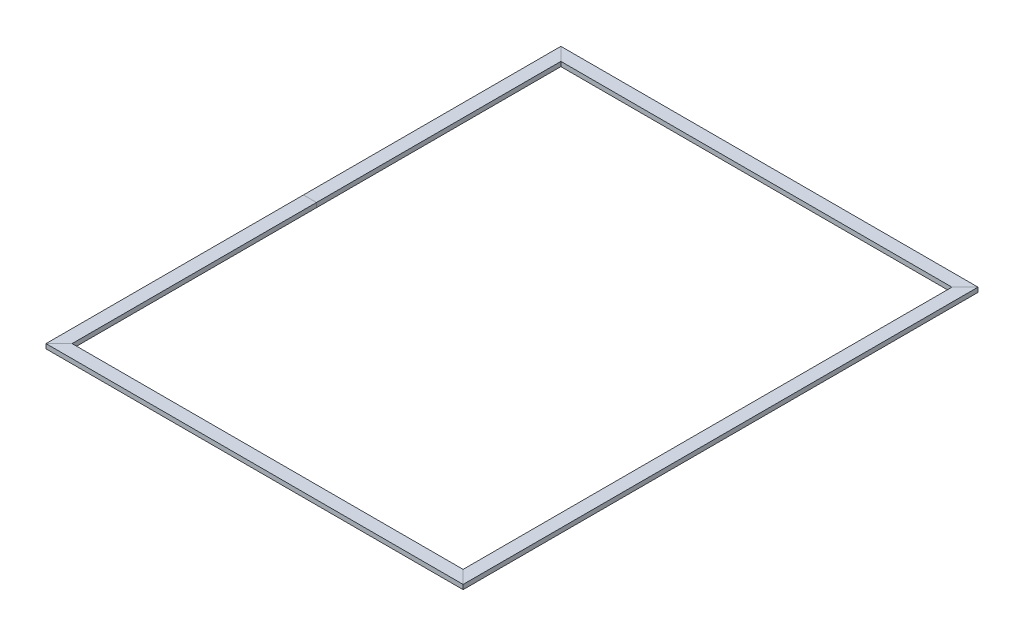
from build123d import *

# Parameters (mm, degrees)
SKETCH2_W = 40
SKETCH2_H = 14


with BuildPart() as part:
    # Sweep1: sweep along a path in Sketch1
    with BuildLine(Plane(origin=(0, 0, 0), x_dir=(1, 0, 0), z_dir=(0, 1, 0))) as sweep1_path:
        Line((-620, -770), (620, -770))
        Line((620, -770), (620, 770))
        Line((620, 770), (-620, 770))
        Line((-620, 770), (-620, -770))
    # Sketch2 → Sweep1 (sweep)
    with BuildSketch(Plane.XY):
        with Locations((-620, 0)):
            Rectangle(SKETCH2_W, SKETCH2_H)
    sweep(path=sweep1_path.line, transition=Transition.RIGHT)


solid = part.part
